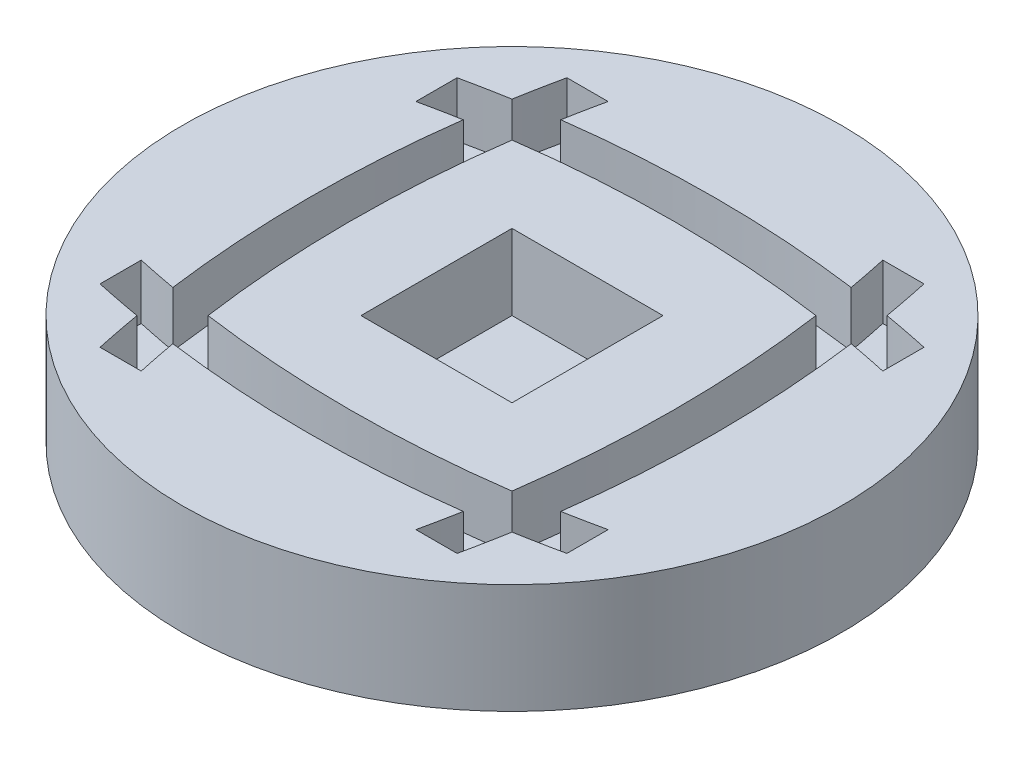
ISO-10303-21;
HEADER;
FILE_DESCRIPTION(('STEP AP214'),'2;1');
FILE_NAME('part.step','',(''),(''),'','','');
FILE_SCHEMA(('AUTOMOTIVE_DESIGN { 1 0 10303 214 1 1 1 1 }'));
ENDSEC;
DATA;
#1=APPLICATION_CONTEXT('core data for automotive mechanical design processes');
#2=APPLICATION_PROTOCOL_DEFINITION('international standard','automotive_design',2000,#1);
#3=PRODUCT_CONTEXT('',#1,'mechanical');
#4=PRODUCT('Part','Part','',(#3));
#5=PRODUCT_RELATED_PRODUCT_CATEGORY('part','',(#4));
#6=PRODUCT_DEFINITION_FORMATION('','',#4);
#7=PRODUCT_DEFINITION_CONTEXT('part definition',#1,'design');
#8=PRODUCT_DEFINITION('design','',#6,#7);
#9=PRODUCT_DEFINITION_SHAPE('','',#8);
#10=(LENGTH_UNIT() NAMED_UNIT(*) SI_UNIT(.MILLI.,.METRE.));
#11=(NAMED_UNIT(*) PLANE_ANGLE_UNIT() SI_UNIT($,.RADIAN.));
#12=(NAMED_UNIT(*) SI_UNIT($,.STERADIAN.) SOLID_ANGLE_UNIT());
#13=UNCERTAINTY_MEASURE_WITH_UNIT(LENGTH_MEASURE(1.E-05),#10,'distance_accuracy_value','');
#14=(GEOMETRIC_REPRESENTATION_CONTEXT(3) GLOBAL_UNCERTAINTY_ASSIGNED_CONTEXT((#13)) GLOBAL_UNIT_ASSIGNED_CONTEXT((#10,
#11,#12)) REPRESENTATION_CONTEXT('',''));
#15=CARTESIAN_POINT('',(0.,0.,0.));
#16=DIRECTION('',(0.,0.,1.));
#17=DIRECTION('',(1.,0.,0.));
#18=AXIS2_PLACEMENT_3D('',#15,#16,#17);
#19=CARTESIAN_POINT('',(0.,8.,0.));
#20=DIRECTION('',(0.,-1.,0.));
#21=DIRECTION('',(0.,0.,-1.));
#22=AXIS2_PLACEMENT_3D('',#19,#20,#21);
#23=CYLINDRICAL_SURFACE('',#22,24.);
#24=CARTESIAN_POINT('',(0.,8.,0.));
#25=DIRECTION('',(0.,1.,0.));
#26=DIRECTION('',(0.,0.,1.));
#27=AXIS2_PLACEMENT_3D('',#24,#25,#26);
#28=CIRCLE('',#27,24.);
#29=CARTESIAN_POINT('',(0.,8.,24.));
#30=VERTEX_POINT('',#29);
#31=EDGE_CURVE('E11',#30,#30,#28,.T.);
#32=ORIENTED_EDGE('',*,*,#31,.F.);
#33=EDGE_LOOP('',(#32));
#34=FACE_BOUND('',#33,.T.);
#35=CARTESIAN_POINT('',(0.,0.,0.));
#36=DIRECTION('',(0.,1.,0.));
#37=DIRECTION('',(0.,0.,1.));
#38=AXIS2_PLACEMENT_3D('',#35,#36,#37);
#39=CIRCLE('',#38,24.);
#40=CARTESIAN_POINT('',(0.,0.,24.));
#41=VERTEX_POINT('',#40);
#42=EDGE_CURVE('E37',#41,#41,#39,.T.);
#43=ORIENTED_EDGE('',*,*,#42,.T.);
#44=EDGE_LOOP('',(#43));
#45=FACE_BOUND('',#44,.T.);
#46=ADVANCED_FACE('F34',(#34,#45),#23,.T.);
#47=CARTESIAN_POINT('',(0.,8.,0.));
#48=DIRECTION('',(0.,1.,0.));
#49=DIRECTION('',(0.,0.,1.));
#50=AXIS2_PLACEMENT_3D('',#47,#48,#49);
#51=PLANE('',#50);
#52=CARTESIAN_POINT('',(0.,8.,65.1728853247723));
#53=DIRECTION('',(0.,1.,0.));
#54=DIRECTION('',(0.,0.,-1.));
#55=AXIS2_PLACEMENT_3D('',#52,#53,#54);
#56=CIRCLE('',#55,80.);
#57=CARTESIAN_POINT('',(-13.6534076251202,8.,-13.6534076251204));
#58=VERTEX_POINT('',#57);
#59=CARTESIAN_POINT('',(-17.,8.,-13.));
#60=VERTEX_POINT('',#59);
#61=EDGE_CURVE('E48',#58,#60,#56,.T.);
#62=ORIENTED_EDGE('',*,*,#61,.F.);
#63=CARTESIAN_POINT('',(65.1728853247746,8.,-3.61937451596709E-12));
#64=DIRECTION('',(0.,1.,0.));
#65=DIRECTION('',(0.,0.,-1.));
#66=AXIS2_PLACEMENT_3D('',#63,#64,#65);
#67=CIRCLE('',#66,80.0000000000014);
#68=CARTESIAN_POINT('',(-12.9999999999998,8.,-17.0000000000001));
#69=VERTEX_POINT('',#68);
#70=EDGE_CURVE('E311',#69,#58,#67,.T.);
#71=ORIENTED_EDGE('',*,*,#70,.F.);
#72=DIRECTION('',(-1.,0.,2.15105711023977E-13));
#73=VECTOR('',#72,1.);
#74=CARTESIAN_POINT('',(-10.0000000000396,8.,-17.0000000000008));
#75=LINE('',#74,#73);
#76=CARTESIAN_POINT('',(-10.0000000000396,8.,-17.0000000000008));
#77=VERTEX_POINT('',#76);
#78=EDGE_CURVE('E469',#77,#69,#75,.T.);
#79=ORIENTED_EDGE('',*,*,#78,.F.);
#80=CARTESIAN_POINT('',(67.4053186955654,8.,-9.76183332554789E-11));
#81=DIRECTION('',(0.,-1.,0.));
#82=DIRECTION('',(0.,0.,-1.));
#83=AXIS2_PLACEMENT_3D('',#80,#81,#82);
#84=CIRCLE('',#83,79.2501316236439);
#85=CARTESIAN_POINT('',(-10.5758870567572,8.,-14.1249747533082));
#86=VERTEX_POINT('',#85);
#87=EDGE_CURVE('E466',#86,#77,#84,.T.);
#88=ORIENTED_EDGE('',*,*,#87,.F.);
#89=CARTESIAN_POINT('',(0.,8.,65.1728853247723));
#90=DIRECTION('',(0.,1.,0.));
#91=DIRECTION('',(0.,0.,-1.));
#92=AXIS2_PLACEMENT_3D('',#89,#90,#91);
#93=CIRCLE('',#92,80.0000000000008);
#94=CARTESIAN_POINT('',(10.5758870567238,8.,-14.1249747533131));
#95=VERTEX_POINT('',#94);
#96=EDGE_CURVE('E463',#95,#86,#93,.T.);
#97=ORIENTED_EDGE('',*,*,#96,.F.);
#98=CARTESIAN_POINT('',(-67.4053186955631,8.,9.37728701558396E-11));
#99=DIRECTION('',(0.,-1.,0.));
#100=DIRECTION('',(0.,0.,-1.));
#101=AXIS2_PLACEMENT_3D('',#98,#99,#100);
#102=CIRCLE('',#101,79.2501316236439);
#103=CARTESIAN_POINT('',(10.0000000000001,8.,-17.));
#104=VERTEX_POINT('',#103);
#105=EDGE_CURVE('E460',#104,#95,#102,.T.);
#106=ORIENTED_EDGE('',*,*,#105,.F.);
#107=DIRECTION('',(-1.,0.,0.));
#108=VECTOR('',#107,1.);
#109=CARTESIAN_POINT('',(13.0000000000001,8.,-17.));
#110=LINE('',#109,#108);
#111=CARTESIAN_POINT('',(13.0000000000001,8.,-17.));
#112=VERTEX_POINT('',#111);
#113=EDGE_CURVE('E457',#112,#104,#110,.T.);
#114=ORIENTED_EDGE('',*,*,#113,.F.);
#115=CARTESIAN_POINT('',(-65.1728853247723,8.,-2.25815189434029E-13));
#116=DIRECTION('',(0.,1.,0.));
#117=DIRECTION('',(0.,0.,-1.));
#118=AXIS2_PLACEMENT_3D('',#115,#116,#117);
#119=CIRCLE('',#118,80.);
#120=CARTESIAN_POINT('',(13.6534076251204,8.,-13.6534076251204));
#121=VERTEX_POINT('',#120);
#122=EDGE_CURVE('E454',#121,#112,#119,.T.);
#123=ORIENTED_EDGE('',*,*,#122,.F.);
#124=CARTESIAN_POINT('',(0.,8.,65.1728853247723));
#125=DIRECTION('',(0.,1.,0.));
#126=DIRECTION('',(0.,0.,-1.));
#127=AXIS2_PLACEMENT_3D('',#124,#125,#126);
#128=CIRCLE('',#127,80.);
#129=CARTESIAN_POINT('',(17.,8.,-13.));
#130=VERTEX_POINT('',#129);
#131=EDGE_CURVE('E451',#130,#121,#128,.T.);
#132=ORIENTED_EDGE('',*,*,#131,.F.);
#133=DIRECTION('',(0.,0.,-1.));
#134=VECTOR('',#133,1.);
#135=CARTESIAN_POINT('',(17.,8.,-10.0000000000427));
#136=LINE('',#135,#134);
#137=CARTESIAN_POINT('',(17.,8.,-10.0000000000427));
#138=VERTEX_POINT('',#137);
#139=EDGE_CURVE('E448',#138,#130,#136,.T.);
#140=ORIENTED_EDGE('',*,*,#139,.F.);
#141=CARTESIAN_POINT('',(9.68253255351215E-11,8.,67.4053186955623));
#142=DIRECTION('',(0.,-1.,0.));
#143=DIRECTION('',(0.,0.,-1.));
#144=AXIS2_PLACEMENT_3D('',#141,#142,#143);
#145=CIRCLE('',#144,79.2501316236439);
#146=CARTESIAN_POINT('',(14.1249747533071,8.,-10.5758870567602));
#147=VERTEX_POINT('',#146);
#148=EDGE_CURVE('E445',#147,#138,#145,.T.);
#149=ORIENTED_EDGE('',*,*,#148,.F.);
#150=CARTESIAN_POINT('',(-65.1728853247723,8.,-2.25815189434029E-13));
#151=DIRECTION('',(0.,1.,0.));
#152=DIRECTION('',(0.,0.,-1.));
#153=AXIS2_PLACEMENT_3D('',#150,#151,#152);
#154=CIRCLE('',#153,80.);
#155=CARTESIAN_POINT('',(14.1249747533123,8.,10.5758870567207));
#156=VERTEX_POINT('',#155);
#157=EDGE_CURVE('E442',#156,#147,#154,.T.);
#158=ORIENTED_EDGE('',*,*,#157,.F.);
#159=CARTESIAN_POINT('',(-9.45576231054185E-11,8.,-67.4053186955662));
#160=DIRECTION('',(0.,-1.,0.));
#161=DIRECTION('',(0.,0.,-1.));
#162=AXIS2_PLACEMENT_3D('',#159,#160,#161);
#163=CIRCLE('',#162,79.2501316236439);
#164=CARTESIAN_POINT('',(17.0000000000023,8.,9.99999999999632));
#165=VERTEX_POINT('',#164);
#166=EDGE_CURVE('E439',#165,#156,#163,.T.);
#167=ORIENTED_EDGE('',*,*,#166,.F.);
#168=DIRECTION('',(0.,0.,-1.));
#169=VECTOR('',#168,1.);
#170=CARTESIAN_POINT('',(17.0000000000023,8.,12.9999999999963));
#171=LINE('',#170,#169);
#172=CARTESIAN_POINT('',(17.0000000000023,8.,12.9999999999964));
#173=VERTEX_POINT('',#172);
#174=EDGE_CURVE('E436',#173,#165,#171,.T.);
#175=ORIENTED_EDGE('',*,*,#174,.F.);
#176=CARTESIAN_POINT('',(4.53365102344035E-13,8.,-65.1728853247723));
#177=DIRECTION('',(0.,1.,0.));
#178=DIRECTION('',(0.,0.,-1.));
#179=AXIS2_PLACEMENT_3D('',#176,#177,#178);
#180=CIRCLE('',#179,79.9999999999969);
#181=CARTESIAN_POINT('',(13.6534076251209,8.,13.6534076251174));
#182=VERTEX_POINT('',#181);
#183=EDGE_CURVE('E433',#182,#173,#180,.T.);
#184=ORIENTED_EDGE('',*,*,#183,.F.);
#185=CARTESIAN_POINT('',(-65.1728853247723,8.,-2.25815189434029E-13));
#186=DIRECTION('',(0.,1.,0.));
#187=DIRECTION('',(0.,0.,-1.));
#188=AXIS2_PLACEMENT_3D('',#185,#186,#187);
#189=CIRCLE('',#188,80.);
#190=CARTESIAN_POINT('',(12.9999999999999,8.,17.));
#191=VERTEX_POINT('',#190);
#192=EDGE_CURVE('E430',#191,#182,#189,.T.);
#193=ORIENTED_EDGE('',*,*,#192,.F.);
#194=DIRECTION('',(1.,0.,1.0327387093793E-12));
#195=VECTOR('',#194,1.);
#196=CARTESIAN_POINT('',(10.0000000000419,8.,16.9999999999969));
#197=LINE('',#196,#195);
#198=CARTESIAN_POINT('',(10.0000000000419,8.,16.999999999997));
#199=VERTEX_POINT('',#198);
#200=EDGE_CURVE('E427',#199,#191,#197,.T.);
#201=ORIENTED_EDGE('',*,*,#200,.F.);
#202=CARTESIAN_POINT('',(-67.4053186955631,8.,9.37728701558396E-11));
#203=DIRECTION('',(0.,-1.,0.));
#204=DIRECTION('',(0.,0.,-1.));
#205=AXIS2_PLACEMENT_3D('',#202,#203,#204);
#206=CIRCLE('',#205,79.2501316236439);
#207=CARTESIAN_POINT('',(10.5758870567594,8.,14.1249747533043));
#208=VERTEX_POINT('',#207);
#209=EDGE_CURVE('E424',#208,#199,#206,.T.);
#210=ORIENTED_EDGE('',*,*,#209,.F.);
#211=CARTESIAN_POINT('',(4.53365102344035E-13,8.,-65.1728853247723));
#212=DIRECTION('',(0.,1.,0.));
#213=DIRECTION('',(0.,0.,-1.));
#214=AXIS2_PLACEMENT_3D('',#211,#212,#213);
#215=CIRCLE('',#214,79.9999999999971);
#216=CARTESIAN_POINT('',(-10.575887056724,8.,14.1249747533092));
#217=VERTEX_POINT('',#216);
#218=EDGE_CURVE('E421',#217,#208,#215,.T.);
#219=ORIENTED_EDGE('',*,*,#218,.F.);
#220=CARTESIAN_POINT('',(67.4053186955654,8.,-9.76183332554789E-11));
#221=DIRECTION('',(0.,-1.,0.));
#222=DIRECTION('',(0.,0.,-1.));
#223=AXIS2_PLACEMENT_3D('',#220,#221,#222);
#224=CIRCLE('',#223,79.2501316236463);
#225=CARTESIAN_POINT('',(-10.0000000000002,8.,16.9999999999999));
#226=VERTEX_POINT('',#225);
#227=EDGE_CURVE('E418',#226,#217,#224,.T.);
#228=ORIENTED_EDGE('',*,*,#227,.F.);
#229=DIRECTION('',(1.,0.,0.));
#230=VECTOR('',#229,1.);
#231=CARTESIAN_POINT('',(-13.0000000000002,8.,16.9999999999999));
#232=LINE('',#231,#230);
#233=CARTESIAN_POINT('',(-12.9999999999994,8.,16.9999999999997));
#234=VERTEX_POINT('',#233);
#235=EDGE_CURVE('E415',#234,#226,#232,.T.);
#236=ORIENTED_EDGE('',*,*,#235,.F.);
#237=CARTESIAN_POINT('',(65.1728853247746,8.,-3.61937451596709E-12));
#238=DIRECTION('',(0.,1.,0.));
#239=DIRECTION('',(0.,0.,-1.));
#240=AXIS2_PLACEMENT_3D('',#237,#238,#239);
#241=CIRCLE('',#240,80.0000000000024);
#242=CARTESIAN_POINT('',(-13.6534076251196,8.,13.6534076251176));
#243=VERTEX_POINT('',#242);
#244=EDGE_CURVE('E412',#243,#234,#241,.T.);
#245=ORIENTED_EDGE('',*,*,#244,.F.);
#246=CARTESIAN_POINT('',(4.53365102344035E-13,8.,-65.1728853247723));
#247=DIRECTION('',(0.,1.,0.));
#248=DIRECTION('',(0.,0.,-1.));
#249=AXIS2_PLACEMENT_3D('',#246,#247,#248);
#250=CIRCLE('',#249,79.9999999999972);
#251=CARTESIAN_POINT('',(-16.9999999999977,8.,12.9999999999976));
#252=VERTEX_POINT('',#251);
#253=EDGE_CURVE('E409',#252,#243,#250,.T.);
#254=ORIENTED_EDGE('',*,*,#253,.F.);
#255=DIRECTION('',(0.,0.,1.));
#256=VECTOR('',#255,1.);
#257=CARTESIAN_POINT('',(-16.9999999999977,8.,10.0000000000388));
#258=LINE('',#257,#256);
#259=CARTESIAN_POINT('',(-16.9999999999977,8.,10.0000000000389));
#260=VERTEX_POINT('',#259);
#261=EDGE_CURVE('E406',#260,#252,#258,.T.);
#262=ORIENTED_EDGE('',*,*,#261,.F.);
#263=CARTESIAN_POINT('',(-9.45576231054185E-11,8.,-67.4053186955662));
#264=DIRECTION('',(0.,-1.,0.));
#265=DIRECTION('',(0.,0.,-1.));
#266=AXIS2_PLACEMENT_3D('',#263,#264,#265);
#267=CIRCLE('',#266,79.2501316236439);
#268=CARTESIAN_POINT('',(-14.1249747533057,8.,10.575887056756));
#269=VERTEX_POINT('',#268);
#270=EDGE_CURVE('E403',#269,#260,#267,.T.);
#271=ORIENTED_EDGE('',*,*,#270,.F.);
#272=CARTESIAN_POINT('',(65.1728853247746,8.,-3.61937451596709E-12));
#273=DIRECTION('',(0.,1.,0.));
#274=DIRECTION('',(0.,0.,-1.));
#275=AXIS2_PLACEMENT_3D('',#272,#273,#274);
#276=CIRCLE('',#275,80.0000000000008);
#277=CARTESIAN_POINT('',(-14.12497475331,8.,-10.5758870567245));
#278=VERTEX_POINT('',#277);
#279=EDGE_CURVE('E400',#278,#269,#276,.T.);
#280=ORIENTED_EDGE('',*,*,#279,.F.);
#281=CARTESIAN_POINT('',(9.68253255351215E-11,8.,67.4053186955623));
#282=DIRECTION('',(0.,-1.,0.));
#283=DIRECTION('',(0.,0.,-1.));
#284=AXIS2_PLACEMENT_3D('',#281,#282,#283);
#285=CIRCLE('',#284,79.2501316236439);
#286=CARTESIAN_POINT('',(-17.,8.,-10.));
#287=VERTEX_POINT('',#286);
#288=EDGE_CURVE('E397',#287,#278,#285,.T.);
#289=ORIENTED_EDGE('',*,*,#288,.F.);
#290=DIRECTION('',(0.,0.,1.));
#291=VECTOR('',#290,1.);
#292=CARTESIAN_POINT('',(-17.,8.,-13.));
#293=LINE('',#292,#291);
#294=EDGE_CURVE('E394',#60,#287,#293,.T.);
#295=ORIENTED_EDGE('',*,*,#294,.F.);
#296=EDGE_LOOP('',(#62,#71,#79,#88,#97,#106,#114,#123,#132,#140,#149,#158,#167,#175,#184,#193,
#201,#210,#219,#228,#236,#245,#254,#262,#271,#280,#289,#295));
#297=FACE_BOUND('',#296,.T.);
#298=ORIENTED_EDGE('',*,*,#31,.T.);
#299=EDGE_LOOP('',(#298));
#300=FACE_BOUND('',#299,.T.);
#301=ADVANCED_FACE('F591',(#297,#300),#51,.T.);
#302=CARTESIAN_POINT('',(0.,0.,0.));
#303=DIRECTION('',(0.,1.,0.));
#304=DIRECTION('',(0.,0.,1.));
#305=AXIS2_PLACEMENT_3D('',#302,#303,#304);
#306=PLANE('',#305);
#307=ORIENTED_EDGE('',*,*,#42,.F.);
#308=EDGE_LOOP('',(#307));
#309=FACE_BOUND('',#308,.T.);
#310=ADVANCED_FACE('F596',(#309),#306,.F.);
#311=CARTESIAN_POINT('',(0.,4.,65.1728853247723));
#312=DIRECTION('',(0.,1.,0.));
#313=DIRECTION('',(0.,0.,1.));
#314=AXIS2_PLACEMENT_3D('',#311,#312,#313);
#315=CYLINDRICAL_SURFACE('',#314,80.);
#316=ORIENTED_EDGE('',*,*,#61,.T.);
#317=DIRECTION('',(0.,1.,0.));
#318=VECTOR('',#317,1.);
#319=CARTESIAN_POINT('',(-17.,4.,-13.));
#320=LINE('',#319,#318);
#321=CARTESIAN_POINT('',(-17.,4.,-13.));
#322=VERTEX_POINT('',#321);
#323=EDGE_CURVE('E392',#322,#60,#320,.T.);
#324=ORIENTED_EDGE('',*,*,#323,.F.);
#325=CARTESIAN_POINT('',(0.,4.,65.1728853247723));
#326=DIRECTION('',(0.,1.,0.));
#327=DIRECTION('',(0.,0.,-1.));
#328=AXIS2_PLACEMENT_3D('',#325,#326,#327);
#329=CIRCLE('',#328,80.);
#330=CARTESIAN_POINT('',(-13.6534076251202,4.,-13.6534076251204));
#331=VERTEX_POINT('',#330);
#332=EDGE_CURVE('E307',#331,#322,#329,.T.);
#333=ORIENTED_EDGE('',*,*,#332,.F.);
#334=DIRECTION('',(0.,1.,0.));
#335=VECTOR('',#334,1.);
#336=CARTESIAN_POINT('',(-13.6534076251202,4.,-13.6534076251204));
#337=LINE('',#336,#335);
#338=EDGE_CURVE('E474',#331,#58,#337,.T.);
#339=ORIENTED_EDGE('',*,*,#338,.T.);
#340=EDGE_LOOP('',(#316,#324,#333,#339));
#341=FACE_BOUND('',#340,.T.);
#342=ADVANCED_FACE('F605',(#341),#315,.F.);
#343=CARTESIAN_POINT('',(65.1728853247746,4.,-3.61937451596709E-12));
#344=DIRECTION('',(0.,1.,0.));
#345=DIRECTION('',(0.,0.,1.));
#346=AXIS2_PLACEMENT_3D('',#343,#344,#345);
#347=CYLINDRICAL_SURFACE('',#346,80.0000000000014);
#348=ORIENTED_EDGE('',*,*,#70,.T.);
#349=ORIENTED_EDGE('',*,*,#338,.F.);
#350=CARTESIAN_POINT('',(65.1728853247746,4.,-3.61937451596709E-12));
#351=DIRECTION('',(0.,1.,0.));
#352=DIRECTION('',(0.,0.,-1.));
#353=AXIS2_PLACEMENT_3D('',#350,#351,#352);
#354=CIRCLE('',#353,80.0000000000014);
#355=CARTESIAN_POINT('',(-12.9999999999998,4.,-17.0000000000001));
#356=VERTEX_POINT('',#355);
#357=EDGE_CURVE('E389',#356,#331,#354,.T.);
#358=ORIENTED_EDGE('',*,*,#357,.F.);
#359=DIRECTION('',(0.,1.,0.));
#360=VECTOR('',#359,1.);
#361=CARTESIAN_POINT('',(-12.9999999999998,4.,-17.0000000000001));
#362=LINE('',#361,#360);
#363=EDGE_CURVE('E477',#356,#69,#362,.T.);
#364=ORIENTED_EDGE('',*,*,#363,.T.);
#365=EDGE_LOOP('',(#348,#349,#358,#364));
#366=FACE_BOUND('',#365,.T.);
#367=ADVANCED_FACE('F609',(#366),#347,.F.);
#368=CARTESIAN_POINT('',(-10.0000000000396,4.,-17.0000000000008));
#369=DIRECTION('',(-2.15105711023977E-13,0.,-1.));
#370=DIRECTION('',(-1.,0.,2.15105711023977E-13));
#371=AXIS2_PLACEMENT_3D('',#368,#369,#370);
#372=PLANE('',#371);
#373=ORIENTED_EDGE('',*,*,#78,.T.);
#374=ORIENTED_EDGE('',*,*,#363,.F.);
#375=DIRECTION('',(-1.,0.,2.15105711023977E-13));
#376=VECTOR('',#375,1.);
#377=CARTESIAN_POINT('',(-10.0000000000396,4.,-17.0000000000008));
#378=LINE('',#377,#376);
#379=CARTESIAN_POINT('',(-10.0000000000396,4.,-17.0000000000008));
#380=VERTEX_POINT('',#379);
#381=EDGE_CURVE('E386',#380,#356,#378,.T.);
#382=ORIENTED_EDGE('',*,*,#381,.F.);
#383=DIRECTION('',(0.,1.,0.));
#384=VECTOR('',#383,1.);
#385=CARTESIAN_POINT('',(-10.0000000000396,4.,-17.0000000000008));
#386=LINE('',#385,#384);
#387=EDGE_CURVE('E479',#380,#77,#386,.T.);
#388=ORIENTED_EDGE('',*,*,#387,.T.);
#389=EDGE_LOOP('',(#373,#374,#382,#388));
#390=FACE_BOUND('',#389,.T.);
#391=ADVANCED_FACE('F721',(#390),#372,.F.);
#392=CARTESIAN_POINT('',(67.4053186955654,4.,-9.76183332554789E-11));
#393=DIRECTION('',(0.,1.,0.));
#394=DIRECTION('',(0.,0.,1.));
#395=AXIS2_PLACEMENT_3D('',#392,#393,#394);
#396=CYLINDRICAL_SURFACE('',#395,79.2501316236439);
#397=ORIENTED_EDGE('',*,*,#87,.T.);
#398=ORIENTED_EDGE('',*,*,#387,.F.);
#399=CARTESIAN_POINT('',(67.4053186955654,4.,-9.76183332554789E-11));
#400=DIRECTION('',(0.,-1.,0.));
#401=DIRECTION('',(0.,0.,-1.));
#402=AXIS2_PLACEMENT_3D('',#399,#400,#401);
#403=CIRCLE('',#402,79.2501316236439);
#404=CARTESIAN_POINT('',(-10.5758870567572,4.,-14.1249747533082));
#405=VERTEX_POINT('',#404);
#406=EDGE_CURVE('E383',#405,#380,#403,.T.);
#407=ORIENTED_EDGE('',*,*,#406,.F.);
#408=DIRECTION('',(0.,1.,0.));
#409=VECTOR('',#408,1.);
#410=CARTESIAN_POINT('',(-10.5758870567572,4.,-14.1249747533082));
#411=LINE('',#410,#409);
#412=EDGE_CURVE('E481',#405,#86,#411,.T.);
#413=ORIENTED_EDGE('',*,*,#412,.T.);
#414=EDGE_LOOP('',(#397,#398,#407,#413));
#415=FACE_BOUND('',#414,.T.);
#416=ADVANCED_FACE('F717',(#415),#396,.T.);
#417=CARTESIAN_POINT('',(0.,4.,65.1728853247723));
#418=DIRECTION('',(0.,1.,0.));
#419=DIRECTION('',(0.,0.,1.));
#420=AXIS2_PLACEMENT_3D('',#417,#418,#419);
#421=CYLINDRICAL_SURFACE('',#420,80.0000000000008);
#422=ORIENTED_EDGE('',*,*,#96,.T.);
#423=ORIENTED_EDGE('',*,*,#412,.F.);
#424=CARTESIAN_POINT('',(0.,4.,65.1728853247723));
#425=DIRECTION('',(0.,1.,0.));
#426=DIRECTION('',(0.,0.,-1.));
#427=AXIS2_PLACEMENT_3D('',#424,#425,#426);
#428=CIRCLE('',#427,80.0000000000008);
#429=CARTESIAN_POINT('',(10.5758870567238,4.,-14.1249747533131));
#430=VERTEX_POINT('',#429);
#431=EDGE_CURVE('E380',#430,#405,#428,.T.);
#432=ORIENTED_EDGE('',*,*,#431,.F.);
#433=DIRECTION('',(0.,1.,0.));
#434=VECTOR('',#433,1.);
#435=CARTESIAN_POINT('',(10.5758870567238,4.,-14.1249747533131));
#436=LINE('',#435,#434);
#437=EDGE_CURVE('E483',#430,#95,#436,.T.);
#438=ORIENTED_EDGE('',*,*,#437,.T.);
#439=EDGE_LOOP('',(#422,#423,#432,#438));
#440=FACE_BOUND('',#439,.T.);
#441=ADVANCED_FACE('F713',(#440),#421,.F.);
#442=CARTESIAN_POINT('',(-67.4053186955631,4.,9.37728701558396E-11));
#443=DIRECTION('',(0.,1.,0.));
#444=DIRECTION('',(0.,0.,1.));
#445=AXIS2_PLACEMENT_3D('',#442,#443,#444);
#446=CYLINDRICAL_SURFACE('',#445,79.2501316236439);
#447=ORIENTED_EDGE('',*,*,#105,.T.);
#448=ORIENTED_EDGE('',*,*,#437,.F.);
#449=CARTESIAN_POINT('',(-67.4053186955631,4.,9.37728701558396E-11));
#450=DIRECTION('',(0.,-1.,0.));
#451=DIRECTION('',(0.,0.,-1.));
#452=AXIS2_PLACEMENT_3D('',#449,#450,#451);
#453=CIRCLE('',#452,79.2501316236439);
#454=CARTESIAN_POINT('',(10.0000000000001,4.,-17.));
#455=VERTEX_POINT('',#454);
#456=EDGE_CURVE('E377',#455,#430,#453,.T.);
#457=ORIENTED_EDGE('',*,*,#456,.F.);
#458=DIRECTION('',(0.,1.,0.));
#459=VECTOR('',#458,1.);
#460=CARTESIAN_POINT('',(10.0000000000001,4.,-17.));
#461=LINE('',#460,#459);
#462=EDGE_CURVE('E485',#455,#104,#461,.T.);
#463=ORIENTED_EDGE('',*,*,#462,.T.);
#464=EDGE_LOOP('',(#447,#448,#457,#463));
#465=FACE_BOUND('',#464,.T.);
#466=ADVANCED_FACE('F709',(#465),#446,.T.);
#467=CARTESIAN_POINT('',(13.0000000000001,4.,-17.));
#468=DIRECTION('',(0.,0.,-1.));
#469=DIRECTION('',(-1.,0.,0.));
#470=AXIS2_PLACEMENT_3D('',#467,#468,#469);
#471=PLANE('',#470);
#472=ORIENTED_EDGE('',*,*,#113,.T.);
#473=ORIENTED_EDGE('',*,*,#462,.F.);
#474=DIRECTION('',(-1.,0.,0.));
#475=VECTOR('',#474,1.);
#476=CARTESIAN_POINT('',(13.0000000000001,4.,-17.));
#477=LINE('',#476,#475);
#478=CARTESIAN_POINT('',(13.0000000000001,4.,-17.));
#479=VERTEX_POINT('',#478);
#480=EDGE_CURVE('E374',#479,#455,#477,.T.);
#481=ORIENTED_EDGE('',*,*,#480,.F.);
#482=DIRECTION('',(0.,1.,0.));
#483=VECTOR('',#482,1.);
#484=CARTESIAN_POINT('',(13.0000000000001,4.,-17.));
#485=LINE('',#484,#483);
#486=EDGE_CURVE('E487',#479,#112,#485,.T.);
#487=ORIENTED_EDGE('',*,*,#486,.T.);
#488=EDGE_LOOP('',(#472,#473,#481,#487));
#489=FACE_BOUND('',#488,.T.);
#490=ADVANCED_FACE('F705',(#489),#471,.F.);
#491=CARTESIAN_POINT('',(-65.1728853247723,4.,-2.25815189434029E-13));
#492=DIRECTION('',(0.,1.,0.));
#493=DIRECTION('',(0.,0.,1.));
#494=AXIS2_PLACEMENT_3D('',#491,#492,#493);
#495=CYLINDRICAL_SURFACE('',#494,80.);
#496=ORIENTED_EDGE('',*,*,#122,.T.);
#497=ORIENTED_EDGE('',*,*,#486,.F.);
#498=CARTESIAN_POINT('',(-65.1728853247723,4.,-2.25815189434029E-13));
#499=DIRECTION('',(0.,1.,0.));
#500=DIRECTION('',(0.,0.,-1.));
#501=AXIS2_PLACEMENT_3D('',#498,#499,#500);
#502=CIRCLE('',#501,80.);
#503=CARTESIAN_POINT('',(13.6534076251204,4.,-13.6534076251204));
#504=VERTEX_POINT('',#503);
#505=EDGE_CURVE('E371',#504,#479,#502,.T.);
#506=ORIENTED_EDGE('',*,*,#505,.F.);
#507=DIRECTION('',(0.,1.,0.));
#508=VECTOR('',#507,1.);
#509=CARTESIAN_POINT('',(13.6534076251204,4.,-13.6534076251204));
#510=LINE('',#509,#508);
#511=EDGE_CURVE('E489',#504,#121,#510,.T.);
#512=ORIENTED_EDGE('',*,*,#511,.T.);
#513=EDGE_LOOP('',(#496,#497,#506,#512));
#514=FACE_BOUND('',#513,.T.);
#515=ADVANCED_FACE('F701',(#514),#495,.F.);
#516=CARTESIAN_POINT('',(0.,4.,65.1728853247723));
#517=DIRECTION('',(0.,1.,0.));
#518=DIRECTION('',(0.,0.,1.));
#519=AXIS2_PLACEMENT_3D('',#516,#517,#518);
#520=CYLINDRICAL_SURFACE('',#519,80.);
#521=ORIENTED_EDGE('',*,*,#131,.T.);
#522=ORIENTED_EDGE('',*,*,#511,.F.);
#523=CARTESIAN_POINT('',(0.,4.,65.1728853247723));
#524=DIRECTION('',(0.,1.,0.));
#525=DIRECTION('',(0.,0.,-1.));
#526=AXIS2_PLACEMENT_3D('',#523,#524,#525);
#527=CIRCLE('',#526,80.);
#528=CARTESIAN_POINT('',(17.,4.,-13.));
#529=VERTEX_POINT('',#528);
#530=EDGE_CURVE('E368',#529,#504,#527,.T.);
#531=ORIENTED_EDGE('',*,*,#530,.F.);
#532=DIRECTION('',(0.,1.,0.));
#533=VECTOR('',#532,1.);
#534=CARTESIAN_POINT('',(17.,4.,-13.));
#535=LINE('',#534,#533);
#536=EDGE_CURVE('E491',#529,#130,#535,.T.);
#537=ORIENTED_EDGE('',*,*,#536,.T.);
#538=EDGE_LOOP('',(#521,#522,#531,#537));
#539=FACE_BOUND('',#538,.T.);
#540=ADVANCED_FACE('F697',(#539),#520,.F.);
#541=CARTESIAN_POINT('',(17.,4.,-10.0000000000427));
#542=DIRECTION('',(1.,0.,0.));
#543=DIRECTION('',(0.,0.,-1.));
#544=AXIS2_PLACEMENT_3D('',#541,#542,#543);
#545=PLANE('',#544);
#546=ORIENTED_EDGE('',*,*,#139,.T.);
#547=ORIENTED_EDGE('',*,*,#536,.F.);
#548=DIRECTION('',(0.,0.,-1.));
#549=VECTOR('',#548,1.);
#550=CARTESIAN_POINT('',(17.,4.,-10.0000000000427));
#551=LINE('',#550,#549);
#552=CARTESIAN_POINT('',(17.,4.,-10.0000000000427));
#553=VERTEX_POINT('',#552);
#554=EDGE_CURVE('E365',#553,#529,#551,.T.);
#555=ORIENTED_EDGE('',*,*,#554,.F.);
#556=DIRECTION('',(0.,1.,0.));
#557=VECTOR('',#556,1.);
#558=CARTESIAN_POINT('',(17.,4.,-10.0000000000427));
#559=LINE('',#558,#557);
#560=EDGE_CURVE('E493',#553,#138,#559,.T.);
#561=ORIENTED_EDGE('',*,*,#560,.T.);
#562=EDGE_LOOP('',(#546,#547,#555,#561));
#563=FACE_BOUND('',#562,.T.);
#564=ADVANCED_FACE('F693',(#563),#545,.F.);
#565=CARTESIAN_POINT('',(9.68253255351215E-11,4.,67.4053186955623));
#566=DIRECTION('',(0.,1.,0.));
#567=DIRECTION('',(0.,0.,1.));
#568=AXIS2_PLACEMENT_3D('',#565,#566,#567);
#569=CYLINDRICAL_SURFACE('',#568,79.2501316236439);
#570=ORIENTED_EDGE('',*,*,#148,.T.);
#571=ORIENTED_EDGE('',*,*,#560,.F.);
#572=CARTESIAN_POINT('',(9.68253255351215E-11,4.,67.4053186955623));
#573=DIRECTION('',(0.,-1.,0.));
#574=DIRECTION('',(0.,0.,-1.));
#575=AXIS2_PLACEMENT_3D('',#572,#573,#574);
#576=CIRCLE('',#575,79.2501316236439);
#577=CARTESIAN_POINT('',(14.1249747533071,4.,-10.5758870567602));
#578=VERTEX_POINT('',#577);
#579=EDGE_CURVE('E362',#578,#553,#576,.T.);
#580=ORIENTED_EDGE('',*,*,#579,.F.);
#581=DIRECTION('',(0.,1.,0.));
#582=VECTOR('',#581,1.);
#583=CARTESIAN_POINT('',(14.1249747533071,4.,-10.5758870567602));
#584=LINE('',#583,#582);
#585=EDGE_CURVE('E495',#578,#147,#584,.T.);
#586=ORIENTED_EDGE('',*,*,#585,.T.);
#587=EDGE_LOOP('',(#570,#571,#580,#586));
#588=FACE_BOUND('',#587,.T.);
#589=ADVANCED_FACE('F689',(#588),#569,.T.);
#590=CARTESIAN_POINT('',(-65.1728853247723,4.,-2.25815189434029E-13));
#591=DIRECTION('',(0.,1.,0.));
#592=DIRECTION('',(0.,0.,1.));
#593=AXIS2_PLACEMENT_3D('',#590,#591,#592);
#594=CYLINDRICAL_SURFACE('',#593,80.);
#595=ORIENTED_EDGE('',*,*,#157,.T.);
#596=ORIENTED_EDGE('',*,*,#585,.F.);
#597=CARTESIAN_POINT('',(-65.1728853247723,4.,-2.25815189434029E-13));
#598=DIRECTION('',(0.,1.,0.));
#599=DIRECTION('',(0.,0.,-1.));
#600=AXIS2_PLACEMENT_3D('',#597,#598,#599);
#601=CIRCLE('',#600,80.);
#602=CARTESIAN_POINT('',(14.1249747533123,4.,10.5758870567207));
#603=VERTEX_POINT('',#602);
#604=EDGE_CURVE('E359',#603,#578,#601,.T.);
#605=ORIENTED_EDGE('',*,*,#604,.F.);
#606=DIRECTION('',(0.,1.,0.));
#607=VECTOR('',#606,1.);
#608=CARTESIAN_POINT('',(14.1249747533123,4.,10.5758870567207));
#609=LINE('',#608,#607);
#610=EDGE_CURVE('E497',#603,#156,#609,.T.);
#611=ORIENTED_EDGE('',*,*,#610,.T.);
#612=EDGE_LOOP('',(#595,#596,#605,#611));
#613=FACE_BOUND('',#612,.T.);
#614=ADVANCED_FACE('F685',(#613),#594,.F.);
#615=CARTESIAN_POINT('',(-9.45576231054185E-11,4.,-67.4053186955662));
#616=DIRECTION('',(0.,1.,0.));
#617=DIRECTION('',(0.,0.,1.));
#618=AXIS2_PLACEMENT_3D('',#615,#616,#617);
#619=CYLINDRICAL_SURFACE('',#618,79.2501316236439);
#620=ORIENTED_EDGE('',*,*,#166,.T.);
#621=ORIENTED_EDGE('',*,*,#610,.F.);
#622=CARTESIAN_POINT('',(-9.45576231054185E-11,4.,-67.4053186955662));
#623=DIRECTION('',(0.,-1.,0.));
#624=DIRECTION('',(0.,0.,-1.));
#625=AXIS2_PLACEMENT_3D('',#622,#623,#624);
#626=CIRCLE('',#625,79.2501316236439);
#627=CARTESIAN_POINT('',(17.0000000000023,4.,9.99999999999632));
#628=VERTEX_POINT('',#627);
#629=EDGE_CURVE('E356',#628,#603,#626,.T.);
#630=ORIENTED_EDGE('',*,*,#629,.F.);
#631=DIRECTION('',(0.,1.,0.));
#632=VECTOR('',#631,1.);
#633=CARTESIAN_POINT('',(17.0000000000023,4.,9.99999999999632));
#634=LINE('',#633,#632);
#635=EDGE_CURVE('E499',#628,#165,#634,.T.);
#636=ORIENTED_EDGE('',*,*,#635,.T.);
#637=EDGE_LOOP('',(#620,#621,#630,#636));
#638=FACE_BOUND('',#637,.T.);
#639=ADVANCED_FACE('F681',(#638),#619,.T.);
#640=CARTESIAN_POINT('',(17.0000000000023,4.,12.9999999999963));
#641=DIRECTION('',(1.,0.,0.));
#642=DIRECTION('',(0.,0.,-1.));
#643=AXIS2_PLACEMENT_3D('',#640,#641,#642);
#644=PLANE('',#643);
#645=ORIENTED_EDGE('',*,*,#174,.T.);
#646=ORIENTED_EDGE('',*,*,#635,.F.);
#647=DIRECTION('',(0.,0.,-1.));
#648=VECTOR('',#647,1.);
#649=CARTESIAN_POINT('',(17.0000000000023,4.,12.9999999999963));
#650=LINE('',#649,#648);
#651=CARTESIAN_POINT('',(17.0000000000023,4.,12.9999999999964));
#652=VERTEX_POINT('',#651);
#653=EDGE_CURVE('E353',#652,#628,#650,.T.);
#654=ORIENTED_EDGE('',*,*,#653,.F.);
#655=DIRECTION('',(0.,1.,0.));
#656=VECTOR('',#655,1.);
#657=CARTESIAN_POINT('',(17.0000000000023,4.,12.9999999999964));
#658=LINE('',#657,#656);
#659=EDGE_CURVE('E501',#652,#173,#658,.T.);
#660=ORIENTED_EDGE('',*,*,#659,.T.);
#661=EDGE_LOOP('',(#645,#646,#654,#660));
#662=FACE_BOUND('',#661,.T.);
#663=ADVANCED_FACE('F677',(#662),#644,.F.);
#664=CARTESIAN_POINT('',(4.53365102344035E-13,4.,-65.1728853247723));
#665=DIRECTION('',(0.,1.,0.));
#666=DIRECTION('',(0.,0.,1.));
#667=AXIS2_PLACEMENT_3D('',#664,#665,#666);
#668=CYLINDRICAL_SURFACE('',#667,79.9999999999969);
#669=ORIENTED_EDGE('',*,*,#183,.T.);
#670=ORIENTED_EDGE('',*,*,#659,.F.);
#671=CARTESIAN_POINT('',(4.53365102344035E-13,4.,-65.1728853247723));
#672=DIRECTION('',(0.,1.,0.));
#673=DIRECTION('',(0.,0.,-1.));
#674=AXIS2_PLACEMENT_3D('',#671,#672,#673);
#675=CIRCLE('',#674,79.9999999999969);
#676=CARTESIAN_POINT('',(13.6534076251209,4.,13.6534076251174));
#677=VERTEX_POINT('',#676);
#678=EDGE_CURVE('E350',#677,#652,#675,.T.);
#679=ORIENTED_EDGE('',*,*,#678,.F.);
#680=DIRECTION('',(0.,1.,0.));
#681=VECTOR('',#680,1.);
#682=CARTESIAN_POINT('',(13.6534076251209,4.,13.6534076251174));
#683=LINE('',#682,#681);
#684=EDGE_CURVE('E503',#677,#182,#683,.T.);
#685=ORIENTED_EDGE('',*,*,#684,.T.);
#686=EDGE_LOOP('',(#669,#670,#679,#685));
#687=FACE_BOUND('',#686,.T.);
#688=ADVANCED_FACE('F673',(#687),#668,.F.);
#689=CARTESIAN_POINT('',(-65.1728853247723,4.,-2.25815189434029E-13));
#690=DIRECTION('',(0.,1.,0.));
#691=DIRECTION('',(0.,0.,1.));
#692=AXIS2_PLACEMENT_3D('',#689,#690,#691);
#693=CYLINDRICAL_SURFACE('',#692,80.);
#694=ORIENTED_EDGE('',*,*,#192,.T.);
#695=ORIENTED_EDGE('',*,*,#684,.F.);
#696=CARTESIAN_POINT('',(-65.1728853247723,4.,-2.25815189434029E-13));
#697=DIRECTION('',(0.,1.,0.));
#698=DIRECTION('',(0.,0.,-1.));
#699=AXIS2_PLACEMENT_3D('',#696,#697,#698);
#700=CIRCLE('',#699,80.);
#701=CARTESIAN_POINT('',(12.9999999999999,4.,17.));
#702=VERTEX_POINT('',#701);
#703=EDGE_CURVE('E347',#702,#677,#700,.T.);
#704=ORIENTED_EDGE('',*,*,#703,.F.);
#705=DIRECTION('',(0.,1.,0.));
#706=VECTOR('',#705,1.);
#707=CARTESIAN_POINT('',(12.9999999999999,4.,17.));
#708=LINE('',#707,#706);
#709=EDGE_CURVE('E505',#702,#191,#708,.T.);
#710=ORIENTED_EDGE('',*,*,#709,.T.);
#711=EDGE_LOOP('',(#694,#695,#704,#710));
#712=FACE_BOUND('',#711,.T.);
#713=ADVANCED_FACE('F669',(#712),#693,.F.);
#714=CARTESIAN_POINT('',(10.0000000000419,4.,16.9999999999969));
#715=DIRECTION('',(-1.0327387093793E-12,0.,1.));
#716=DIRECTION('',(1.,0.,1.0327387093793E-12));
#717=AXIS2_PLACEMENT_3D('',#714,#715,#716);
#718=PLANE('',#717);
#719=ORIENTED_EDGE('',*,*,#200,.T.);
#720=ORIENTED_EDGE('',*,*,#709,.F.);
#721=DIRECTION('',(1.,0.,1.0327387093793E-12));
#722=VECTOR('',#721,1.);
#723=CARTESIAN_POINT('',(10.0000000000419,4.,16.9999999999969));
#724=LINE('',#723,#722);
#725=CARTESIAN_POINT('',(10.0000000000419,4.,16.999999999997));
#726=VERTEX_POINT('',#725);
#727=EDGE_CURVE('E344',#726,#702,#724,.T.);
#728=ORIENTED_EDGE('',*,*,#727,.F.);
#729=DIRECTION('',(0.,1.,0.));
#730=VECTOR('',#729,1.);
#731=CARTESIAN_POINT('',(10.0000000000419,4.,16.999999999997));
#732=LINE('',#731,#730);
#733=EDGE_CURVE('E507',#726,#199,#732,.T.);
#734=ORIENTED_EDGE('',*,*,#733,.T.);
#735=EDGE_LOOP('',(#719,#720,#728,#734));
#736=FACE_BOUND('',#735,.T.);
#737=ADVANCED_FACE('F665',(#736),#718,.F.);
#738=CARTESIAN_POINT('',(-67.4053186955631,4.,9.37728701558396E-11));
#739=DIRECTION('',(0.,1.,0.));
#740=DIRECTION('',(0.,0.,1.));
#741=AXIS2_PLACEMENT_3D('',#738,#739,#740);
#742=CYLINDRICAL_SURFACE('',#741,79.2501316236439);
#743=ORIENTED_EDGE('',*,*,#209,.T.);
#744=ORIENTED_EDGE('',*,*,#733,.F.);
#745=CARTESIAN_POINT('',(-67.4053186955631,4.,9.37728701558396E-11));
#746=DIRECTION('',(0.,-1.,0.));
#747=DIRECTION('',(0.,0.,-1.));
#748=AXIS2_PLACEMENT_3D('',#745,#746,#747);
#749=CIRCLE('',#748,79.2501316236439);
#750=CARTESIAN_POINT('',(10.5758870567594,4.,14.1249747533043));
#751=VERTEX_POINT('',#750);
#752=EDGE_CURVE('E341',#751,#726,#749,.T.);
#753=ORIENTED_EDGE('',*,*,#752,.F.);
#754=DIRECTION('',(0.,1.,0.));
#755=VECTOR('',#754,1.);
#756=CARTESIAN_POINT('',(10.5758870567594,4.,14.1249747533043));
#757=LINE('',#756,#755);
#758=EDGE_CURVE('E509',#751,#208,#757,.T.);
#759=ORIENTED_EDGE('',*,*,#758,.T.);
#760=EDGE_LOOP('',(#743,#744,#753,#759));
#761=FACE_BOUND('',#760,.T.);
#762=ADVANCED_FACE('F661',(#761),#742,.T.);
#763=CARTESIAN_POINT('',(4.53365102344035E-13,4.,-65.1728853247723));
#764=DIRECTION('',(0.,1.,0.));
#765=DIRECTION('',(0.,0.,1.));
#766=AXIS2_PLACEMENT_3D('',#763,#764,#765);
#767=CYLINDRICAL_SURFACE('',#766,79.9999999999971);
#768=ORIENTED_EDGE('',*,*,#218,.T.);
#769=ORIENTED_EDGE('',*,*,#758,.F.);
#770=CARTESIAN_POINT('',(4.53365102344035E-13,4.,-65.1728853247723));
#771=DIRECTION('',(0.,1.,0.));
#772=DIRECTION('',(0.,0.,-1.));
#773=AXIS2_PLACEMENT_3D('',#770,#771,#772);
#774=CIRCLE('',#773,79.9999999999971);
#775=CARTESIAN_POINT('',(-10.575887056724,4.,14.1249747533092));
#776=VERTEX_POINT('',#775);
#777=EDGE_CURVE('E338',#776,#751,#774,.T.);
#778=ORIENTED_EDGE('',*,*,#777,.F.);
#779=DIRECTION('',(0.,1.,0.));
#780=VECTOR('',#779,1.);
#781=CARTESIAN_POINT('',(-10.575887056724,4.,14.1249747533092));
#782=LINE('',#781,#780);
#783=EDGE_CURVE('E511',#776,#217,#782,.T.);
#784=ORIENTED_EDGE('',*,*,#783,.T.);
#785=EDGE_LOOP('',(#768,#769,#778,#784));
#786=FACE_BOUND('',#785,.T.);
#787=ADVANCED_FACE('F657',(#786),#767,.F.);
#788=CARTESIAN_POINT('',(67.4053186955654,4.,-9.76183332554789E-11));
#789=DIRECTION('',(0.,1.,0.));
#790=DIRECTION('',(0.,0.,1.));
#791=AXIS2_PLACEMENT_3D('',#788,#789,#790);
#792=CYLINDRICAL_SURFACE('',#791,79.2501316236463);
#793=ORIENTED_EDGE('',*,*,#227,.T.);
#794=ORIENTED_EDGE('',*,*,#783,.F.);
#795=CARTESIAN_POINT('',(67.4053186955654,4.,-9.76183332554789E-11));
#796=DIRECTION('',(0.,-1.,0.));
#797=DIRECTION('',(0.,0.,-1.));
#798=AXIS2_PLACEMENT_3D('',#795,#796,#797);
#799=CIRCLE('',#798,79.2501316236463);
#800=CARTESIAN_POINT('',(-10.0000000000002,4.,16.9999999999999));
#801=VERTEX_POINT('',#800);
#802=EDGE_CURVE('E335',#801,#776,#799,.T.);
#803=ORIENTED_EDGE('',*,*,#802,.F.);
#804=DIRECTION('',(0.,1.,0.));
#805=VECTOR('',#804,1.);
#806=CARTESIAN_POINT('',(-10.0000000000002,4.,16.9999999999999));
#807=LINE('',#806,#805);
#808=EDGE_CURVE('E513',#801,#226,#807,.T.);
#809=ORIENTED_EDGE('',*,*,#808,.T.);
#810=EDGE_LOOP('',(#793,#794,#803,#809));
#811=FACE_BOUND('',#810,.T.);
#812=ADVANCED_FACE('F653',(#811),#792,.T.);
#813=CARTESIAN_POINT('',(-13.0000000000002,4.,16.9999999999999));
#814=DIRECTION('',(0.,0.,1.));
#815=DIRECTION('',(1.,0.,0.));
#816=AXIS2_PLACEMENT_3D('',#813,#814,#815);
#817=PLANE('',#816);
#818=ORIENTED_EDGE('',*,*,#235,.T.);
#819=ORIENTED_EDGE('',*,*,#808,.F.);
#820=DIRECTION('',(1.,0.,0.));
#821=VECTOR('',#820,1.);
#822=CARTESIAN_POINT('',(-13.0000000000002,4.,16.9999999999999));
#823=LINE('',#822,#821);
#824=CARTESIAN_POINT('',(-12.9999999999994,4.,16.9999999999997));
#825=VERTEX_POINT('',#824);
#826=EDGE_CURVE('E332',#825,#801,#823,.T.);
#827=ORIENTED_EDGE('',*,*,#826,.F.);
#828=DIRECTION('',(0.,1.,0.));
#829=VECTOR('',#828,1.);
#830=CARTESIAN_POINT('',(-12.9999999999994,4.,16.9999999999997));
#831=LINE('',#830,#829);
#832=EDGE_CURVE('E515',#825,#234,#831,.T.);
#833=ORIENTED_EDGE('',*,*,#832,.T.);
#834=EDGE_LOOP('',(#818,#819,#827,#833));
#835=FACE_BOUND('',#834,.T.);
#836=ADVANCED_FACE('F649',(#835),#817,.F.);
#837=CARTESIAN_POINT('',(65.1728853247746,4.,-3.61937451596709E-12));
#838=DIRECTION('',(0.,1.,0.));
#839=DIRECTION('',(0.,0.,1.));
#840=AXIS2_PLACEMENT_3D('',#837,#838,#839);
#841=CYLINDRICAL_SURFACE('',#840,80.0000000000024);
#842=ORIENTED_EDGE('',*,*,#244,.T.);
#843=ORIENTED_EDGE('',*,*,#832,.F.);
#844=CARTESIAN_POINT('',(65.1728853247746,4.,-3.61937451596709E-12));
#845=DIRECTION('',(0.,1.,0.));
#846=DIRECTION('',(0.,0.,-1.));
#847=AXIS2_PLACEMENT_3D('',#844,#845,#846);
#848=CIRCLE('',#847,80.0000000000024);
#849=CARTESIAN_POINT('',(-13.6534076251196,4.,13.6534076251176));
#850=VERTEX_POINT('',#849);
#851=EDGE_CURVE('E329',#850,#825,#848,.T.);
#852=ORIENTED_EDGE('',*,*,#851,.F.);
#853=DIRECTION('',(0.,1.,0.));
#854=VECTOR('',#853,1.);
#855=CARTESIAN_POINT('',(-13.6534076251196,4.,13.6534076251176));
#856=LINE('',#855,#854);
#857=EDGE_CURVE('E517',#850,#243,#856,.T.);
#858=ORIENTED_EDGE('',*,*,#857,.T.);
#859=EDGE_LOOP('',(#842,#843,#852,#858));
#860=FACE_BOUND('',#859,.T.);
#861=ADVANCED_FACE('F645',(#860),#841,.F.);
#862=CARTESIAN_POINT('',(4.53365102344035E-13,4.,-65.1728853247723));
#863=DIRECTION('',(0.,1.,0.));
#864=DIRECTION('',(0.,0.,1.));
#865=AXIS2_PLACEMENT_3D('',#862,#863,#864);
#866=CYLINDRICAL_SURFACE('',#865,79.9999999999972);
#867=ORIENTED_EDGE('',*,*,#253,.T.);
#868=ORIENTED_EDGE('',*,*,#857,.F.);
#869=CARTESIAN_POINT('',(4.53365102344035E-13,4.,-65.1728853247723));
#870=DIRECTION('',(0.,1.,0.));
#871=DIRECTION('',(0.,0.,-1.));
#872=AXIS2_PLACEMENT_3D('',#869,#870,#871);
#873=CIRCLE('',#872,79.9999999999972);
#874=CARTESIAN_POINT('',(-16.9999999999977,4.,12.9999999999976));
#875=VERTEX_POINT('',#874);
#876=EDGE_CURVE('E326',#875,#850,#873,.T.);
#877=ORIENTED_EDGE('',*,*,#876,.F.);
#878=DIRECTION('',(0.,1.,0.));
#879=VECTOR('',#878,1.);
#880=CARTESIAN_POINT('',(-16.9999999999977,4.,12.9999999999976));
#881=LINE('',#880,#879);
#882=EDGE_CURVE('E519',#875,#252,#881,.T.);
#883=ORIENTED_EDGE('',*,*,#882,.T.);
#884=EDGE_LOOP('',(#867,#868,#877,#883));
#885=FACE_BOUND('',#884,.T.);
#886=ADVANCED_FACE('F641',(#885),#866,.F.);
#887=CARTESIAN_POINT('',(-16.9999999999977,4.,10.0000000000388));
#888=DIRECTION('',(-1.,0.,0.));
#889=DIRECTION('',(0.,0.,1.));
#890=AXIS2_PLACEMENT_3D('',#887,#888,#889);
#891=PLANE('',#890);
#892=ORIENTED_EDGE('',*,*,#261,.T.);
#893=ORIENTED_EDGE('',*,*,#882,.F.);
#894=DIRECTION('',(0.,0.,1.));
#895=VECTOR('',#894,1.);
#896=CARTESIAN_POINT('',(-16.9999999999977,4.,10.0000000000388));
#897=LINE('',#896,#895);
#898=CARTESIAN_POINT('',(-16.9999999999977,4.,10.0000000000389));
#899=VERTEX_POINT('',#898);
#900=EDGE_CURVE('E323',#899,#875,#897,.T.);
#901=ORIENTED_EDGE('',*,*,#900,.F.);
#902=DIRECTION('',(0.,1.,0.));
#903=VECTOR('',#902,1.);
#904=CARTESIAN_POINT('',(-16.9999999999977,4.,10.0000000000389));
#905=LINE('',#904,#903);
#906=EDGE_CURVE('E521',#899,#260,#905,.T.);
#907=ORIENTED_EDGE('',*,*,#906,.T.);
#908=EDGE_LOOP('',(#892,#893,#901,#907));
#909=FACE_BOUND('',#908,.T.);
#910=ADVANCED_FACE('F637',(#909),#891,.F.);
#911=CARTESIAN_POINT('',(-9.45576231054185E-11,4.,-67.4053186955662));
#912=DIRECTION('',(0.,1.,0.));
#913=DIRECTION('',(0.,0.,1.));
#914=AXIS2_PLACEMENT_3D('',#911,#912,#913);
#915=CYLINDRICAL_SURFACE('',#914,79.2501316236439);
#916=ORIENTED_EDGE('',*,*,#270,.T.);
#917=ORIENTED_EDGE('',*,*,#906,.F.);
#918=CARTESIAN_POINT('',(-9.45576231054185E-11,4.,-67.4053186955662));
#919=DIRECTION('',(0.,-1.,0.));
#920=DIRECTION('',(0.,0.,-1.));
#921=AXIS2_PLACEMENT_3D('',#918,#919,#920);
#922=CIRCLE('',#921,79.2501316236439);
#923=CARTESIAN_POINT('',(-14.1249747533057,4.,10.575887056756));
#924=VERTEX_POINT('',#923);
#925=EDGE_CURVE('E320',#924,#899,#922,.T.);
#926=ORIENTED_EDGE('',*,*,#925,.F.);
#927=DIRECTION('',(0.,1.,0.));
#928=VECTOR('',#927,1.);
#929=CARTESIAN_POINT('',(-14.1249747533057,4.,10.575887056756));
#930=LINE('',#929,#928);
#931=EDGE_CURVE('E523',#924,#269,#930,.T.);
#932=ORIENTED_EDGE('',*,*,#931,.T.);
#933=EDGE_LOOP('',(#916,#917,#926,#932));
#934=FACE_BOUND('',#933,.T.);
#935=ADVANCED_FACE('F633',(#934),#915,.T.);
#936=CARTESIAN_POINT('',(65.1728853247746,4.,-3.61937451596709E-12));
#937=DIRECTION('',(0.,1.,0.));
#938=DIRECTION('',(0.,0.,1.));
#939=AXIS2_PLACEMENT_3D('',#936,#937,#938);
#940=CYLINDRICAL_SURFACE('',#939,80.0000000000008);
#941=ORIENTED_EDGE('',*,*,#279,.T.);
#942=ORIENTED_EDGE('',*,*,#931,.F.);
#943=CARTESIAN_POINT('',(65.1728853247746,4.,-3.61937451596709E-12));
#944=DIRECTION('',(0.,1.,0.));
#945=DIRECTION('',(0.,0.,-1.));
#946=AXIS2_PLACEMENT_3D('',#943,#944,#945);
#947=CIRCLE('',#946,80.0000000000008);
#948=CARTESIAN_POINT('',(-14.12497475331,4.,-10.5758870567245));
#949=VERTEX_POINT('',#948);
#950=EDGE_CURVE('E317',#949,#924,#947,.T.);
#951=ORIENTED_EDGE('',*,*,#950,.F.);
#952=DIRECTION('',(0.,1.,0.));
#953=VECTOR('',#952,1.);
#954=CARTESIAN_POINT('',(-14.12497475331,4.,-10.5758870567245));
#955=LINE('',#954,#953);
#956=EDGE_CURVE('E525',#949,#278,#955,.T.);
#957=ORIENTED_EDGE('',*,*,#956,.T.);
#958=EDGE_LOOP('',(#941,#942,#951,#957));
#959=FACE_BOUND('',#958,.T.);
#960=ADVANCED_FACE('F629',(#959),#940,.F.);
#961=CARTESIAN_POINT('',(9.68253255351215E-11,4.,67.4053186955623));
#962=DIRECTION('',(0.,1.,0.));
#963=DIRECTION('',(0.,0.,1.));
#964=AXIS2_PLACEMENT_3D('',#961,#962,#963);
#965=CYLINDRICAL_SURFACE('',#964,79.2501316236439);
#966=ORIENTED_EDGE('',*,*,#288,.T.);
#967=ORIENTED_EDGE('',*,*,#956,.F.);
#968=CARTESIAN_POINT('',(9.68253255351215E-11,4.,67.4053186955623));
#969=DIRECTION('',(0.,-1.,0.));
#970=DIRECTION('',(0.,0.,-1.));
#971=AXIS2_PLACEMENT_3D('',#968,#969,#970);
#972=CIRCLE('',#971,79.2501316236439);
#973=CARTESIAN_POINT('',(-17.,4.,-10.));
#974=VERTEX_POINT('',#973);
#975=EDGE_CURVE('E314',#974,#949,#972,.T.);
#976=ORIENTED_EDGE('',*,*,#975,.F.);
#977=DIRECTION('',(0.,1.,0.));
#978=VECTOR('',#977,1.);
#979=CARTESIAN_POINT('',(-17.,4.,-10.));
#980=LINE('',#979,#978);
#981=EDGE_CURVE('E527',#974,#287,#980,.T.);
#982=ORIENTED_EDGE('',*,*,#981,.T.);
#983=EDGE_LOOP('',(#966,#967,#976,#982));
#984=FACE_BOUND('',#983,.T.);
#985=ADVANCED_FACE('F625',(#984),#965,.T.);
#986=CARTESIAN_POINT('',(-17.,4.,-13.));
#987=DIRECTION('',(-1.,0.,0.));
#988=DIRECTION('',(0.,0.,1.));
#989=AXIS2_PLACEMENT_3D('',#986,#987,#988);
#990=PLANE('',#989);
#991=ORIENTED_EDGE('',*,*,#294,.T.);
#992=ORIENTED_EDGE('',*,*,#981,.F.);
#993=DIRECTION('',(0.,0.,1.));
#994=VECTOR('',#993,1.);
#995=CARTESIAN_POINT('',(-17.,4.,-13.));
#996=LINE('',#995,#994);
#997=EDGE_CURVE('E310',#322,#974,#996,.T.);
#998=ORIENTED_EDGE('',*,*,#997,.F.);
#999=ORIENTED_EDGE('',*,*,#323,.T.);
#1000=EDGE_LOOP('',(#991,#992,#998,#999));
#1001=FACE_BOUND('',#1000,.T.);
#1002=ADVANCED_FACE('F622',(#1001),#990,.F.);
#1003=CARTESIAN_POINT('',(0.,4.,65.1728853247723));
#1004=DIRECTION('',(0.,-1.,0.));
#1005=DIRECTION('',(0.,0.,-1.));
#1006=AXIS2_PLACEMENT_3D('',#1003,#1004,#1005);
#1007=PLANE('',#1006);
#1008=CARTESIAN_POINT('',(67.4053186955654,4.,-9.76183332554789E-11));
#1009=DIRECTION('',(0.,1.,0.));
#1010=DIRECTION('',(0.,0.,-1.));
#1011=AXIS2_PLACEMENT_3D('',#1008,#1009,#1010);
#1012=CIRCLE('',#1011,79.2501316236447);
#1013=CARTESIAN_POINT('',(-11.0681172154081,4.,-11.0681172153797));
#1014=VERTEX_POINT('',#1013);
#1015=CARTESIAN_POINT('',(-11.0681172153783,4.,11.0681172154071));
#1016=VERTEX_POINT('',#1015);
#1017=EDGE_CURVE('E285',#1014,#1016,#1012,.T.);
#1018=ORIENTED_EDGE('',*,*,#1017,.F.);
#1019=CARTESIAN_POINT('',(9.68253255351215E-11,4.,67.4053186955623));
#1020=DIRECTION('',(0.,1.,0.));
#1021=DIRECTION('',(0.,0.,-1.));
#1022=AXIS2_PLACEMENT_3D('',#1019,#1020,#1021);
#1023=CIRCLE('',#1022,79.2501316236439);
#1024=CARTESIAN_POINT('',(11.068117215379,4.,-11.0681172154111));
#1025=VERTEX_POINT('',#1024);
#1026=EDGE_CURVE('E278',#1025,#1014,#1023,.T.);
#1027=ORIENTED_EDGE('',*,*,#1026,.F.);
#1028=CARTESIAN_POINT('',(-67.4053186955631,4.,9.37728701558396E-11));
#1029=DIRECTION('',(0.,1.,0.));
#1030=DIRECTION('',(0.,0.,-1.));
#1031=AXIS2_PLACEMENT_3D('',#1028,#1029,#1030);
#1032=CIRCLE('',#1031,79.2501316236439);
#1033=CARTESIAN_POINT('',(11.0681172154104,4.,11.0681172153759));
#1034=VERTEX_POINT('',#1033);
#1035=EDGE_CURVE('E288',#1034,#1025,#1032,.T.);
#1036=ORIENTED_EDGE('',*,*,#1035,.F.);
#1037=CARTESIAN_POINT('',(-9.45576231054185E-11,4.,-67.4053186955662));
#1038=DIRECTION('',(0.,1.,0.));
#1039=DIRECTION('',(0.,0.,-1.));
#1040=AXIS2_PLACEMENT_3D('',#1037,#1038,#1039);
#1041=CIRCLE('',#1040,79.2501316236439);
#1042=EDGE_CURVE('E270',#1016,#1034,#1041,.T.);
#1043=ORIENTED_EDGE('',*,*,#1042,.F.);
#1044=EDGE_LOOP('',(#1018,#1027,#1036,#1043));
#1045=FACE_BOUND('',#1044,.T.);
#1046=ORIENTED_EDGE('',*,*,#332,.T.);
#1047=ORIENTED_EDGE('',*,*,#997,.T.);
#1048=ORIENTED_EDGE('',*,*,#975,.T.);
#1049=ORIENTED_EDGE('',*,*,#950,.T.);
#1050=ORIENTED_EDGE('',*,*,#925,.T.);
#1051=ORIENTED_EDGE('',*,*,#900,.T.);
#1052=ORIENTED_EDGE('',*,*,#876,.T.);
#1053=ORIENTED_EDGE('',*,*,#851,.T.);
#1054=ORIENTED_EDGE('',*,*,#826,.T.);
#1055=ORIENTED_EDGE('',*,*,#802,.T.);
#1056=ORIENTED_EDGE('',*,*,#777,.T.);
#1057=ORIENTED_EDGE('',*,*,#752,.T.);
#1058=ORIENTED_EDGE('',*,*,#727,.T.);
#1059=ORIENTED_EDGE('',*,*,#703,.T.);
#1060=ORIENTED_EDGE('',*,*,#678,.T.);
#1061=ORIENTED_EDGE('',*,*,#653,.T.);
#1062=ORIENTED_EDGE('',*,*,#629,.T.);
#1063=ORIENTED_EDGE('',*,*,#604,.T.);
#1064=ORIENTED_EDGE('',*,*,#579,.T.);
#1065=ORIENTED_EDGE('',*,*,#554,.T.);
#1066=ORIENTED_EDGE('',*,*,#530,.T.);
#1067=ORIENTED_EDGE('',*,*,#505,.T.);
#1068=ORIENTED_EDGE('',*,*,#480,.T.);
#1069=ORIENTED_EDGE('',*,*,#456,.T.);
#1070=ORIENTED_EDGE('',*,*,#431,.T.);
#1071=ORIENTED_EDGE('',*,*,#406,.T.);
#1072=ORIENTED_EDGE('',*,*,#381,.T.);
#1073=ORIENTED_EDGE('',*,*,#357,.T.);
#1074=EDGE_LOOP('',(#1046,#1047,#1048,#1049,#1050,#1051,#1052,#1053,#1054,#1055,#1056,#1057,
#1058,#1059,#1060,#1061,#1062,#1063,#1064,#1065,#1066,#1067,#1068,#1069,#1070,#1071,#1072,#1073));
#1075=FACE_BOUND('',#1074,.T.);
#1076=ADVANCED_FACE('F282',(#1045,#1075),#1007,.F.);
#1077=CARTESIAN_POINT('',(67.4053186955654,4.,-9.76183332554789E-11));
#1078=DIRECTION('',(0.,1.,0.));
#1079=DIRECTION('',(0.,0.,1.));
#1080=AXIS2_PLACEMENT_3D('',#1077,#1078,#1079);
#1081=CYLINDRICAL_SURFACE('',#1080,79.2501316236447);
#1082=CARTESIAN_POINT('',(67.4053186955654,8.,-9.76183332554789E-11));
#1083=DIRECTION('',(0.,1.,0.));
#1084=DIRECTION('',(0.,0.,-1.));
#1085=AXIS2_PLACEMENT_3D('',#1082,#1083,#1084);
#1086=CIRCLE('',#1085,79.2501316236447);
#1087=CARTESIAN_POINT('',(-11.0681172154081,8.,-11.0681172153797));
#1088=VERTEX_POINT('',#1087);
#1089=CARTESIAN_POINT('',(-11.0681172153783,8.,11.0681172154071));
#1090=VERTEX_POINT('',#1089);
#1091=EDGE_CURVE('E299',#1088,#1090,#1086,.T.);
#1092=ORIENTED_EDGE('',*,*,#1091,.F.);
#1093=DIRECTION('',(0.,1.,0.));
#1094=VECTOR('',#1093,1.);
#1095=CARTESIAN_POINT('',(-11.0681172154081,4.,-11.0681172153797));
#1096=LINE('',#1095,#1094);
#1097=EDGE_CURVE('E291',#1014,#1088,#1096,.T.);
#1098=ORIENTED_EDGE('',*,*,#1097,.F.);
#1099=ORIENTED_EDGE('',*,*,#1017,.T.);
#1100=DIRECTION('',(0.,1.,0.));
#1101=VECTOR('',#1100,1.);
#1102=CARTESIAN_POINT('',(-11.0681172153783,4.,11.0681172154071));
#1103=LINE('',#1102,#1101);
#1104=EDGE_CURVE('E267',#1016,#1090,#1103,.T.);
#1105=ORIENTED_EDGE('',*,*,#1104,.T.);
#1106=EDGE_LOOP('',(#1092,#1098,#1099,#1105));
#1107=FACE_BOUND('',#1106,.T.);
#1108=ADVANCED_FACE('F290',(#1107),#1081,.T.);
#1109=CARTESIAN_POINT('',(9.68253255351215E-11,4.,67.4053186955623));
#1110=DIRECTION('',(0.,1.,0.));
#1111=DIRECTION('',(0.,0.,1.));
#1112=AXIS2_PLACEMENT_3D('',#1109,#1110,#1111);
#1113=CYLINDRICAL_SURFACE('',#1112,79.2501316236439);
#1114=CARTESIAN_POINT('',(9.68253255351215E-11,8.,67.4053186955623));
#1115=DIRECTION('',(0.,1.,0.));
#1116=DIRECTION('',(0.,0.,-1.));
#1117=AXIS2_PLACEMENT_3D('',#1114,#1115,#1116);
#1118=CIRCLE('',#1117,79.2501316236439);
#1119=CARTESIAN_POINT('',(11.068117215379,8.,-11.0681172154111));
#1120=VERTEX_POINT('',#1119);
#1121=EDGE_CURVE('E292',#1120,#1088,#1118,.T.);
#1122=ORIENTED_EDGE('',*,*,#1121,.F.);
#1123=DIRECTION('',(0.,1.,0.));
#1124=VECTOR('',#1123,1.);
#1125=CARTESIAN_POINT('',(11.068117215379,4.,-11.0681172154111));
#1126=LINE('',#1125,#1124);
#1127=EDGE_CURVE('E304',#1025,#1120,#1126,.T.);
#1128=ORIENTED_EDGE('',*,*,#1127,.F.);
#1129=ORIENTED_EDGE('',*,*,#1026,.T.);
#1130=ORIENTED_EDGE('',*,*,#1097,.T.);
#1131=EDGE_LOOP('',(#1122,#1128,#1129,#1130));
#1132=FACE_BOUND('',#1131,.T.);
#1133=ADVANCED_FACE('F732',(#1132),#1113,.T.);
#1134=CARTESIAN_POINT('',(-67.4053186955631,4.,9.37728701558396E-11));
#1135=DIRECTION('',(0.,1.,0.));
#1136=DIRECTION('',(0.,0.,1.));
#1137=AXIS2_PLACEMENT_3D('',#1134,#1135,#1136);
#1138=CYLINDRICAL_SURFACE('',#1137,79.2501316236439);
#1139=CARTESIAN_POINT('',(-67.4053186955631,8.,9.37728701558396E-11));
#1140=DIRECTION('',(0.,1.,0.));
#1141=DIRECTION('',(0.,0.,-1.));
#1142=AXIS2_PLACEMENT_3D('',#1139,#1140,#1141);
#1143=CIRCLE('',#1142,79.2501316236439);
#1144=CARTESIAN_POINT('',(11.0681172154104,8.,11.0681172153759));
#1145=VERTEX_POINT('',#1144);
#1146=EDGE_CURVE('E56',#1145,#1120,#1143,.T.);
#1147=ORIENTED_EDGE('',*,*,#1146,.F.);
#1148=DIRECTION('',(0.,1.,0.));
#1149=VECTOR('',#1148,1.);
#1150=CARTESIAN_POINT('',(11.0681172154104,4.,11.0681172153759));
#1151=LINE('',#1150,#1149);
#1152=EDGE_CURVE('E277',#1034,#1145,#1151,.T.);
#1153=ORIENTED_EDGE('',*,*,#1152,.F.);
#1154=ORIENTED_EDGE('',*,*,#1035,.T.);
#1155=ORIENTED_EDGE('',*,*,#1127,.T.);
#1156=EDGE_LOOP('',(#1147,#1153,#1154,#1155));
#1157=FACE_BOUND('',#1156,.T.);
#1158=ADVANCED_FACE('F619',(#1157),#1138,.T.);
#1159=CARTESIAN_POINT('',(-9.45576231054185E-11,4.,-67.4053186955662));
#1160=DIRECTION('',(0.,1.,0.));
#1161=DIRECTION('',(0.,0.,1.));
#1162=AXIS2_PLACEMENT_3D('',#1159,#1160,#1161);
#1163=CYLINDRICAL_SURFACE('',#1162,79.2501316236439);
#1164=CARTESIAN_POINT('',(-9.45576231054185E-11,8.,-67.4053186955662));
#1165=DIRECTION('',(0.,1.,0.));
#1166=DIRECTION('',(0.,0.,-1.));
#1167=AXIS2_PLACEMENT_3D('',#1164,#1165,#1166);
#1168=CIRCLE('',#1167,79.2501316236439);
#1169=EDGE_CURVE('E272',#1090,#1145,#1168,.T.);
#1170=ORIENTED_EDGE('',*,*,#1169,.F.);
#1171=ORIENTED_EDGE('',*,*,#1104,.F.);
#1172=ORIENTED_EDGE('',*,*,#1042,.T.);
#1173=ORIENTED_EDGE('',*,*,#1152,.T.);
#1174=EDGE_LOOP('',(#1170,#1171,#1172,#1173));
#1175=FACE_BOUND('',#1174,.T.);
#1176=ADVANCED_FACE('F269',(#1175),#1163,.T.);
#1177=CARTESIAN_POINT('',(0.,2.5,0.));
#1178=DIRECTION('',(0.,-1.,0.));
#1179=DIRECTION('',(0.,0.,-1.));
#1180=AXIS2_PLACEMENT_3D('',#1177,#1178,#1179);
#1181=PLANE('',#1180);
#1182=DIRECTION('',(0.,0.,1.));
#1183=VECTOR('',#1182,1.);
#1184=CARTESIAN_POINT('',(-5.5,2.5,5.5));
#1185=LINE('',#1184,#1183);
#1186=CARTESIAN_POINT('',(-5.5,2.5,-5.5));
#1187=VERTEX_POINT('',#1186);
#1188=CARTESIAN_POINT('',(-5.5,2.5,5.5));
#1189=VERTEX_POINT('',#1188);
#1190=EDGE_CURVE('E530',#1187,#1189,#1185,.T.);
#1191=ORIENTED_EDGE('',*,*,#1190,.T.);
#1192=DIRECTION('',(1.,0.,0.));
#1193=VECTOR('',#1192,1.);
#1194=CARTESIAN_POINT('',(5.5,2.5,5.5));
#1195=LINE('',#1194,#1193);
#1196=CARTESIAN_POINT('',(5.5,2.5,5.5));
#1197=VERTEX_POINT('',#1196);
#1198=EDGE_CURVE('E533',#1189,#1197,#1195,.T.);
#1199=ORIENTED_EDGE('',*,*,#1198,.T.);
#1200=DIRECTION('',(0.,0.,-1.));
#1201=VECTOR('',#1200,1.);
#1202=CARTESIAN_POINT('',(5.5,2.5,-5.5));
#1203=LINE('',#1202,#1201);
#1204=CARTESIAN_POINT('',(5.5,2.5,-5.5));
#1205=VERTEX_POINT('',#1204);
#1206=EDGE_CURVE('E537',#1197,#1205,#1203,.T.);
#1207=ORIENTED_EDGE('',*,*,#1206,.T.);
#1208=DIRECTION('',(-1.,0.,0.));
#1209=VECTOR('',#1208,1.);
#1210=CARTESIAN_POINT('',(-5.5,2.5,-5.5));
#1211=LINE('',#1210,#1209);
#1212=EDGE_CURVE('E540',#1205,#1187,#1211,.T.);
#1213=ORIENTED_EDGE('',*,*,#1212,.T.);
#1214=EDGE_LOOP('',(#1191,#1199,#1207,#1213));
#1215=FACE_BOUND('',#1214,.T.);
#1216=ADVANCED_FACE('F577',(#1215),#1181,.F.);
#1217=CARTESIAN_POINT('',(5.5,2.5,5.5));
#1218=DIRECTION('',(0.,0.,1.));
#1219=DIRECTION('',(1.,0.,0.));
#1220=AXIS2_PLACEMENT_3D('',#1217,#1218,#1219);
#1221=PLANE('',#1220);
#1222=DIRECTION('',(1.,0.,0.));
#1223=VECTOR('',#1222,1.);
#1224=CARTESIAN_POINT('',(5.5,8.,5.5));
#1225=LINE('',#1224,#1223);
#1226=CARTESIAN_POINT('',(-5.5,8.,5.5));
#1227=VERTEX_POINT('',#1226);
#1228=CARTESIAN_POINT('',(5.5,8.,5.5));
#1229=VERTEX_POINT('',#1228);
#1230=EDGE_CURVE('E545',#1227,#1229,#1225,.T.);
#1231=ORIENTED_EDGE('',*,*,#1230,.T.);
#1232=DIRECTION('',(0.,1.,0.));
#1233=VECTOR('',#1232,1.);
#1234=CARTESIAN_POINT('',(5.5,2.5,5.5));
#1235=LINE('',#1234,#1233);
#1236=EDGE_CURVE('E557',#1197,#1229,#1235,.T.);
#1237=ORIENTED_EDGE('',*,*,#1236,.F.);
#1238=ORIENTED_EDGE('',*,*,#1198,.F.);
#1239=DIRECTION('',(0.,1.,0.));
#1240=VECTOR('',#1239,1.);
#1241=CARTESIAN_POINT('',(-5.5,2.5,5.5));
#1242=LINE('',#1241,#1240);
#1243=EDGE_CURVE('E543',#1189,#1227,#1242,.T.);
#1244=ORIENTED_EDGE('',*,*,#1243,.T.);
#1245=EDGE_LOOP('',(#1231,#1237,#1238,#1244));
#1246=FACE_BOUND('',#1245,.T.);
#1247=ADVANCED_FACE('F563',(#1246),#1221,.F.);
#1248=CARTESIAN_POINT('',(5.5,2.5,-5.5));
#1249=DIRECTION('',(1.,0.,0.));
#1250=DIRECTION('',(0.,0.,-1.));
#1251=AXIS2_PLACEMENT_3D('',#1248,#1249,#1250);
#1252=PLANE('',#1251);
#1253=DIRECTION('',(0.,0.,-1.));
#1254=VECTOR('',#1253,1.);
#1255=CARTESIAN_POINT('',(5.5,8.,-5.5));
#1256=LINE('',#1255,#1254);
#1257=CARTESIAN_POINT('',(5.5,8.,-5.5));
#1258=VERTEX_POINT('',#1257);
#1259=EDGE_CURVE('E548',#1229,#1258,#1256,.T.);
#1260=ORIENTED_EDGE('',*,*,#1259,.T.);
#1261=DIRECTION('',(0.,1.,0.));
#1262=VECTOR('',#1261,1.);
#1263=CARTESIAN_POINT('',(5.5,2.5,-5.5));
#1264=LINE('',#1263,#1262);
#1265=EDGE_CURVE('E555',#1205,#1258,#1264,.T.);
#1266=ORIENTED_EDGE('',*,*,#1265,.F.);
#1267=ORIENTED_EDGE('',*,*,#1206,.F.);
#1268=ORIENTED_EDGE('',*,*,#1236,.T.);
#1269=EDGE_LOOP('',(#1260,#1266,#1267,#1268));
#1270=FACE_BOUND('',#1269,.T.);
#1271=ADVANCED_FACE('F573',(#1270),#1252,.F.);
#1272=CARTESIAN_POINT('',(-5.5,2.5,-5.5));
#1273=DIRECTION('',(0.,0.,-1.));
#1274=DIRECTION('',(-1.,0.,0.));
#1275=AXIS2_PLACEMENT_3D('',#1272,#1273,#1274);
#1276=PLANE('',#1275);
#1277=DIRECTION('',(-1.,0.,0.));
#1278=VECTOR('',#1277,1.);
#1279=CARTESIAN_POINT('',(-5.5,8.,-5.5));
#1280=LINE('',#1279,#1278);
#1281=CARTESIAN_POINT('',(-5.5,8.,-5.5));
#1282=VERTEX_POINT('',#1281);
#1283=EDGE_CURVE('E534',#1258,#1282,#1280,.T.);
#1284=ORIENTED_EDGE('',*,*,#1283,.T.);
#1285=DIRECTION('',(0.,1.,0.));
#1286=VECTOR('',#1285,1.);
#1287=CARTESIAN_POINT('',(-5.5,2.5,-5.5));
#1288=LINE('',#1287,#1286);
#1289=EDGE_CURVE('E553',#1187,#1282,#1288,.T.);
#1290=ORIENTED_EDGE('',*,*,#1289,.F.);
#1291=ORIENTED_EDGE('',*,*,#1212,.F.);
#1292=ORIENTED_EDGE('',*,*,#1265,.T.);
#1293=EDGE_LOOP('',(#1284,#1290,#1291,#1292));
#1294=FACE_BOUND('',#1293,.T.);
#1295=ADVANCED_FACE('F580',(#1294),#1276,.F.);
#1296=CARTESIAN_POINT('',(-5.5,2.5,5.5));
#1297=DIRECTION('',(-1.,0.,0.));
#1298=DIRECTION('',(0.,0.,1.));
#1299=AXIS2_PLACEMENT_3D('',#1296,#1297,#1298);
#1300=PLANE('',#1299);
#1301=DIRECTION('',(0.,0.,1.));
#1302=VECTOR('',#1301,1.);
#1303=CARTESIAN_POINT('',(-5.5,8.,5.5));
#1304=LINE('',#1303,#1302);
#1305=EDGE_CURVE('E476',#1282,#1227,#1304,.T.);
#1306=ORIENTED_EDGE('',*,*,#1305,.T.);
#1307=ORIENTED_EDGE('',*,*,#1243,.F.);
#1308=ORIENTED_EDGE('',*,*,#1190,.F.);
#1309=ORIENTED_EDGE('',*,*,#1289,.T.);
#1310=EDGE_LOOP('',(#1306,#1307,#1308,#1309));
#1311=FACE_BOUND('',#1310,.T.);
#1312=ADVANCED_FACE('F578',(#1311),#1300,.F.);
#1313=ORIENTED_EDGE('',*,*,#1305,.F.);
#1314=ORIENTED_EDGE('',*,*,#1283,.F.);
#1315=ORIENTED_EDGE('',*,*,#1259,.F.);
#1316=ORIENTED_EDGE('',*,*,#1230,.F.);
#1317=EDGE_LOOP('',(#1313,#1314,#1315,#1316));
#1318=FACE_BOUND('',#1317,.T.);
#1319=ORIENTED_EDGE('',*,*,#1121,.T.);
#1320=ORIENTED_EDGE('',*,*,#1091,.T.);
#1321=ORIENTED_EDGE('',*,*,#1169,.T.);
#1322=ORIENTED_EDGE('',*,*,#1146,.T.);
#1323=EDGE_LOOP('',(#1319,#1320,#1321,#1322));
#1324=FACE_BOUND('',#1323,.T.);
#1325=ADVANCED_FACE('F569',(#1318,#1324),#51,.T.);
#1326=CLOSED_SHELL('',(#46,#301,#310,#342,#367,#391,#416,#441,#466,#490,#515,#540,#564,#589,
#614,#639,#663,#688,#713,#737,#762,#787,#812,#836,#861,#886,#910,#935,#960,#985,#1002,#1076,
#1108,#1133,#1158,#1176,#1216,#1247,#1271,#1295,#1312,#1325));
#1327=MANIFOLD_SOLID_BREP('B2',#1326);
#1328=ADVANCED_BREP_SHAPE_REPRESENTATION('',(#18,#1327),#14);
#1329=SHAPE_DEFINITION_REPRESENTATION(#9,#1328);
ENDSEC;
END-ISO-10303-21;
